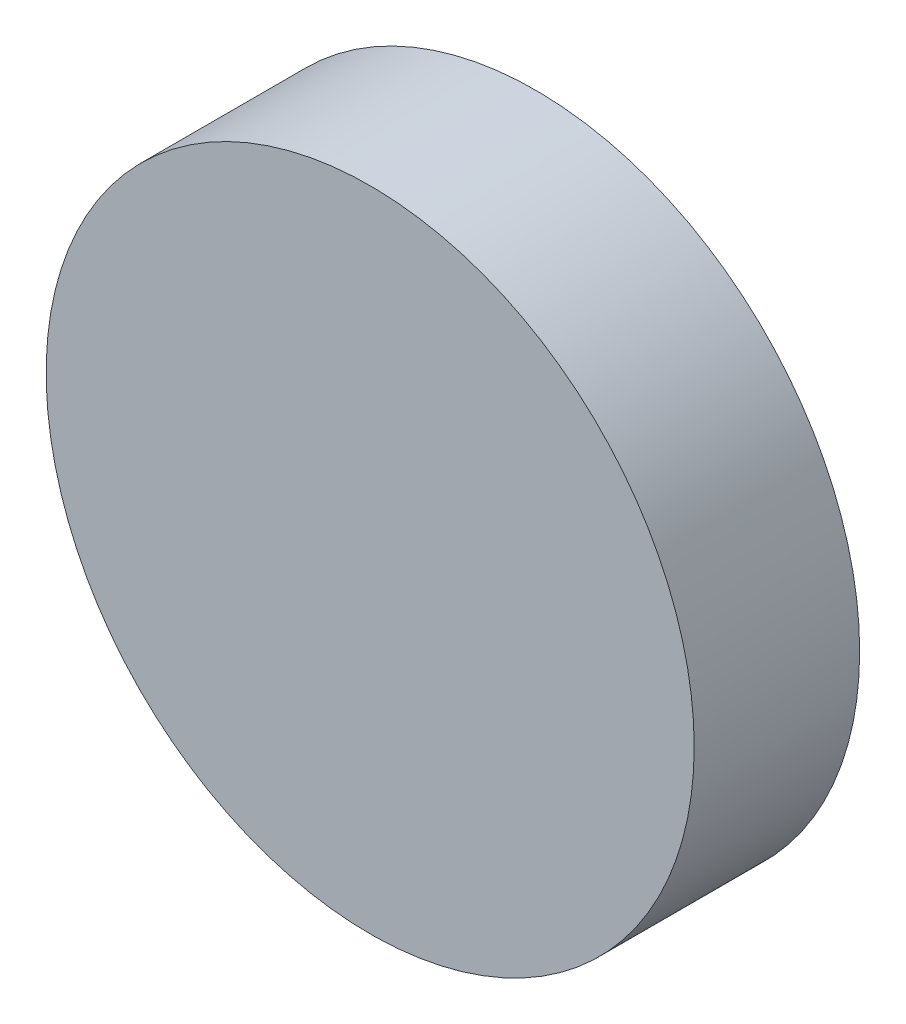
from build123d import *

# Parameters (mm, degrees)
BOSS_EXTRUDE1_DEPTH      = 5
BOSS_EXTRUDE1_DEPTH_BACK = 7
SKETCH1_R                = 23.5
SKETCH2_R                = 18.5
SKETCH2_R_2              = 13.25
BOSS_EXTRUDE2_DEPTH      = 1.5
SKETCH3_R                = 7.95
CUT_EXTRUDE1_DEPTH       = 7


with BuildPart() as part:
    # Sketch1 → Boss-Extrude1 (new, two sides: drawn at the far end of the back side and taken through both)
    with BuildSketch(Plane.XY.offset(-BOSS_EXTRUDE1_DEPTH_BACK)):
        Circle(SKETCH1_R)
    extrude(amount=BOSS_EXTRUDE1_DEPTH + BOSS_EXTRUDE1_DEPTH_BACK)

    # Sketch2 → Boss-Extrude2 (add)
    with BuildSketch(Plane(origin=(0, 0, -7), x_dir=(-1, 0, 0), z_dir=(0, 0, -1))):
        with Locations(Location((0, 0, 0), (0, 0, 180))):
            Circle(SKETCH2_R)
        Circle(SKETCH2_R_2, mode=Mode.SUBTRACT)
    extrude(amount=BOSS_EXTRUDE2_DEPTH)

    # Sketch3 → Cut-Extrude1 (cut)
    with BuildSketch(Plane(origin=(0, 0, -7), x_dir=(-1, 0, 0), z_dir=(0, 0, -1))):
        Circle(SKETCH3_R)
    extrude(amount=-CUT_EXTRUDE1_DEPTH, mode=Mode.SUBTRACT)


solid = part.part
